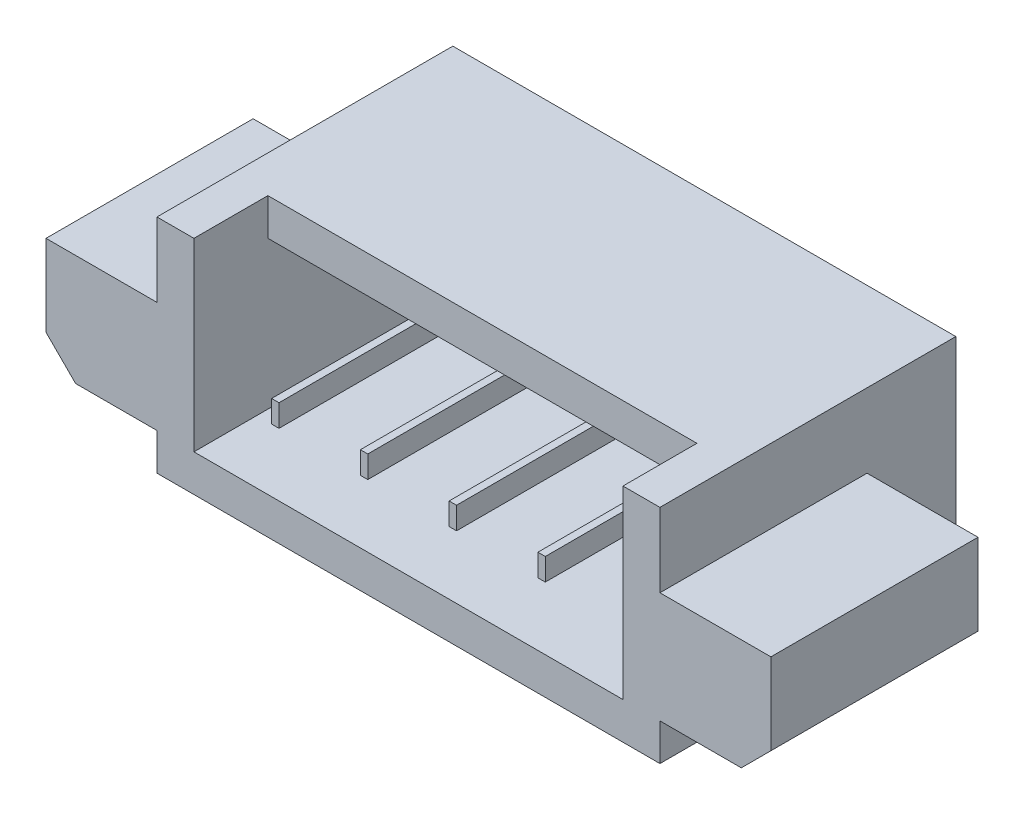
ISO-10303-21;
HEADER;
FILE_DESCRIPTION(('STEP AP214'),'2;1');
FILE_NAME('part.step','',(''),(''),'','','');
FILE_SCHEMA(('AUTOMOTIVE_DESIGN { 1 0 10303 214 1 1 1 1 }'));
ENDSEC;
DATA;
#1=APPLICATION_CONTEXT('core data for automotive mechanical design processes');
#2=APPLICATION_PROTOCOL_DEFINITION('international standard','automotive_design',2000,#1);
#3=PRODUCT_CONTEXT('',#1,'mechanical');
#4=PRODUCT('Part','Part','',(#3));
#5=PRODUCT_RELATED_PRODUCT_CATEGORY('part','',(#4));
#6=PRODUCT_DEFINITION_FORMATION('','',#4);
#7=PRODUCT_DEFINITION_CONTEXT('part definition',#1,'design');
#8=PRODUCT_DEFINITION('design','',#6,#7);
#9=PRODUCT_DEFINITION_SHAPE('','',#8);
#10=(LENGTH_UNIT() NAMED_UNIT(*) SI_UNIT(.MILLI.,.METRE.));
#11=(NAMED_UNIT(*) PLANE_ANGLE_UNIT() SI_UNIT($,.RADIAN.));
#12=(NAMED_UNIT(*) SI_UNIT($,.STERADIAN.) SOLID_ANGLE_UNIT());
#13=UNCERTAINTY_MEASURE_WITH_UNIT(LENGTH_MEASURE(1.E-05),#10,'distance_accuracy_value','');
#14=(GEOMETRIC_REPRESENTATION_CONTEXT(3) GLOBAL_UNCERTAINTY_ASSIGNED_CONTEXT((#13)) GLOBAL_UNIT_ASSIGNED_CONTEXT((#10,
#11,#12)) REPRESENTATION_CONTEXT('',''));
#15=CARTESIAN_POINT('',(0.,0.,0.));
#16=DIRECTION('',(0.,0.,1.));
#17=DIRECTION('',(1.,0.,0.));
#18=AXIS2_PLACEMENT_3D('',#15,#16,#17);
#19=CARTESIAN_POINT('',(0.,0.,0.5));
#20=DIRECTION('',(0.,0.,-1.));
#21=DIRECTION('',(-1.,0.,0.));
#22=AXIS2_PLACEMENT_3D('',#19,#20,#21);
#23=PLANE('',#22);
#24=DIRECTION('',(1.,0.,0.));
#25=VECTOR('',#24,1.);
#26=CARTESIAN_POINT('',(0.55,-0.15,0.5));
#27=LINE('',#26,#25);
#28=CARTESIAN_POINT('',(0.55,-0.15,0.5));
#29=VERTEX_POINT('',#28);
#30=CARTESIAN_POINT('',(0.65,-0.15,0.5));
#31=VERTEX_POINT('',#30);
#32=EDGE_CURVE('E288',#29,#31,#27,.T.);
#33=ORIENTED_EDGE('',*,*,#32,.F.);
#34=DIRECTION('',(0.,-1.,0.));
#35=VECTOR('',#34,1.);
#36=CARTESIAN_POINT('',(0.55,0.15,0.5));
#37=LINE('',#36,#35);
#38=CARTESIAN_POINT('',(0.55,0.15,0.5));
#39=VERTEX_POINT('',#38);
#40=EDGE_CURVE('E301',#39,#29,#37,.T.);
#41=ORIENTED_EDGE('',*,*,#40,.F.);
#42=DIRECTION('',(-1.,0.,0.));
#43=VECTOR('',#42,1.);
#44=CARTESIAN_POINT('',(0.55,0.15,0.5));
#45=LINE('',#44,#43);
#46=CARTESIAN_POINT('',(0.649999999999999,0.15,0.5));
#47=VERTEX_POINT('',#46);
#48=EDGE_CURVE('E310',#47,#39,#45,.T.);
#49=ORIENTED_EDGE('',*,*,#48,.F.);
#50=DIRECTION('',(0.,1.,0.));
#51=VECTOR('',#50,1.);
#52=CARTESIAN_POINT('',(0.649999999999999,0.15,0.5));
#53=LINE('',#52,#51);
#54=EDGE_CURVE('E291',#31,#47,#53,.T.);
#55=ORIENTED_EDGE('',*,*,#54,.F.);
#56=EDGE_LOOP('',(#33,#41,#49,#55));
#57=FACE_BOUND('',#56,.T.);
#58=DIRECTION('',(0.,1.,0.));
#59=VECTOR('',#58,1.);
#60=CARTESIAN_POINT('',(-1.75,0.15,0.5));
#61=LINE('',#60,#59);
#62=CARTESIAN_POINT('',(-1.75,-0.15,0.5));
#63=VERTEX_POINT('',#62);
#64=CARTESIAN_POINT('',(-1.75,0.15,0.5));
#65=VERTEX_POINT('',#64);
#66=EDGE_CURVE('E359',#63,#65,#61,.T.);
#67=ORIENTED_EDGE('',*,*,#66,.F.);
#68=DIRECTION('',(1.,0.,0.));
#69=VECTOR('',#68,1.);
#70=CARTESIAN_POINT('',(-1.85,-0.15,0.5));
#71=LINE('',#70,#69);
#72=CARTESIAN_POINT('',(-1.85,-0.15,0.5));
#73=VERTEX_POINT('',#72);
#74=EDGE_CURVE('E364',#73,#63,#71,.T.);
#75=ORIENTED_EDGE('',*,*,#74,.F.);
#76=DIRECTION('',(0.,-1.,0.));
#77=VECTOR('',#76,1.);
#78=CARTESIAN_POINT('',(-1.85,0.15,0.5));
#79=LINE('',#78,#77);
#80=CARTESIAN_POINT('',(-1.85,0.15,0.5));
#81=VERTEX_POINT('',#80);
#82=EDGE_CURVE('E376',#81,#73,#79,.T.);
#83=ORIENTED_EDGE('',*,*,#82,.F.);
#84=DIRECTION('',(-1.,0.,0.));
#85=VECTOR('',#84,1.);
#86=CARTESIAN_POINT('',(-1.85,0.15,0.5));
#87=LINE('',#86,#85);
#88=EDGE_CURVE('E373',#65,#81,#87,.T.);
#89=ORIENTED_EDGE('',*,*,#88,.F.);
#90=EDGE_LOOP('',(#67,#75,#83,#89));
#91=FACE_BOUND('',#90,.T.);
#92=DIRECTION('',(0.,1.,0.));
#93=VECTOR('',#92,1.);
#94=CARTESIAN_POINT('',(-2.9,1.,0.5));
#95=LINE('',#94,#93);
#96=CARTESIAN_POINT('',(-2.9,-1.,0.5));
#97=VERTEX_POINT('',#96);
#98=CARTESIAN_POINT('',(-2.9,1.,0.5));
#99=VERTEX_POINT('',#98);
#100=EDGE_CURVE('E414',#97,#99,#95,.T.);
#101=ORIENTED_EDGE('',*,*,#100,.F.);
#102=DIRECTION('',(-1.,0.,0.));
#103=VECTOR('',#102,1.);
#104=CARTESIAN_POINT('',(-2.9,-1.,0.5));
#105=LINE('',#104,#103);
#106=CARTESIAN_POINT('',(2.9,-1.,0.5));
#107=VERTEX_POINT('',#106);
#108=EDGE_CURVE('E411',#107,#97,#105,.T.);
#109=ORIENTED_EDGE('',*,*,#108,.F.);
#110=DIRECTION('',(0.,-1.,0.));
#111=VECTOR('',#110,1.);
#112=CARTESIAN_POINT('',(2.9,1.,0.5));
#113=LINE('',#112,#111);
#114=CARTESIAN_POINT('',(2.9,1.,0.5));
#115=VERTEX_POINT('',#114);
#116=EDGE_CURVE('E407',#115,#107,#113,.T.);
#117=ORIENTED_EDGE('',*,*,#116,.F.);
#118=DIRECTION('',(1.,0.,0.));
#119=VECTOR('',#118,1.);
#120=CARTESIAN_POINT('',(-2.9,1.,0.5));
#121=LINE('',#120,#119);
#122=EDGE_CURVE('E11',#99,#115,#121,.T.);
#123=ORIENTED_EDGE('',*,*,#122,.F.);
#124=EDGE_LOOP('',(#101,#109,#117,#123));
#125=FACE_BOUND('',#124,.T.);
#126=DIRECTION('',(1.,0.,0.));
#127=VECTOR('',#126,1.);
#128=CARTESIAN_POINT('',(-0.65,-0.15,0.5));
#129=LINE('',#128,#127);
#130=CARTESIAN_POINT('',(-0.65,-0.15,0.5));
#131=VERTEX_POINT('',#130);
#132=CARTESIAN_POINT('',(-0.55,-0.15,0.5));
#133=VERTEX_POINT('',#132);
#134=EDGE_CURVE('E326',#131,#133,#129,.T.);
#135=ORIENTED_EDGE('',*,*,#134,.F.);
#136=DIRECTION('',(0.,-1.,0.));
#137=VECTOR('',#136,1.);
#138=CARTESIAN_POINT('',(-0.65,0.15,0.5));
#139=LINE('',#138,#137);
#140=CARTESIAN_POINT('',(-0.65,0.15,0.5));
#141=VERTEX_POINT('',#140);
#142=EDGE_CURVE('E331',#141,#131,#139,.T.);
#143=ORIENTED_EDGE('',*,*,#142,.F.);
#144=DIRECTION('',(-1.,0.,0.));
#145=VECTOR('',#144,1.);
#146=CARTESIAN_POINT('',(-0.65,0.15,0.5));
#147=LINE('',#146,#145);
#148=CARTESIAN_POINT('',(-0.55,0.15,0.5));
#149=VERTEX_POINT('',#148);
#150=EDGE_CURVE('E343',#149,#141,#147,.T.);
#151=ORIENTED_EDGE('',*,*,#150,.F.);
#152=DIRECTION('',(0.,1.,0.));
#153=VECTOR('',#152,1.);
#154=CARTESIAN_POINT('',(-0.55,0.15,0.5));
#155=LINE('',#154,#153);
#156=EDGE_CURVE('E340',#133,#149,#155,.T.);
#157=ORIENTED_EDGE('',*,*,#156,.F.);
#158=EDGE_LOOP('',(#135,#143,#151,#157));
#159=FACE_BOUND('',#158,.T.);
#160=DIRECTION('',(1.,0.,0.));
#161=VECTOR('',#160,1.);
#162=CARTESIAN_POINT('',(1.75,-0.15,0.5));
#163=LINE('',#162,#161);
#164=CARTESIAN_POINT('',(1.75,-0.15,0.5));
#165=VERTEX_POINT('',#164);
#166=CARTESIAN_POINT('',(1.85,-0.15,0.5));
#167=VERTEX_POINT('',#166);
#168=EDGE_CURVE('E287',#165,#167,#163,.T.);
#169=ORIENTED_EDGE('',*,*,#168,.F.);
#170=DIRECTION('',(0.,-1.,0.));
#171=VECTOR('',#170,1.);
#172=CARTESIAN_POINT('',(1.75,0.15,0.5));
#173=LINE('',#172,#171);
#174=CARTESIAN_POINT('',(1.75,0.15,0.5));
#175=VERTEX_POINT('',#174);
#176=EDGE_CURVE('E284',#175,#165,#173,.T.);
#177=ORIENTED_EDGE('',*,*,#176,.F.);
#178=DIRECTION('',(-1.,0.,0.));
#179=VECTOR('',#178,1.);
#180=CARTESIAN_POINT('',(1.75,0.15,0.5));
#181=LINE('',#180,#179);
#182=CARTESIAN_POINT('',(1.85,0.15,0.5));
#183=VERTEX_POINT('',#182);
#184=EDGE_CURVE('E54',#183,#175,#181,.T.);
#185=ORIENTED_EDGE('',*,*,#184,.F.);
#186=DIRECTION('',(0.,1.,0.));
#187=VECTOR('',#186,1.);
#188=CARTESIAN_POINT('',(1.85,0.15,0.5));
#189=LINE('',#188,#187);
#190=EDGE_CURVE('E49',#167,#183,#189,.T.);
#191=ORIENTED_EDGE('',*,*,#190,.F.);
#192=EDGE_LOOP('',(#169,#177,#185,#191));
#193=FACE_BOUND('',#192,.T.);
#194=ADVANCED_FACE('F34',(#57,#91,#125,#159,#193),#23,.F.);
#195=CARTESIAN_POINT('',(-2.9,1.,4.));
#196=DIRECTION('',(1.,0.,0.));
#197=DIRECTION('',(0.,0.,-1.));
#198=AXIS2_PLACEMENT_3D('',#195,#196,#197);
#199=PLANE('',#198);
#200=DIRECTION('',(0.,0.,-1.));
#201=VECTOR('',#200,1.);
#202=CARTESIAN_POINT('',(-2.9,-1.,4.));
#203=LINE('',#202,#201);
#204=CARTESIAN_POINT('',(-2.9,-1.,4.));
#205=VERTEX_POINT('',#204);
#206=EDGE_CURVE('E505',#205,#97,#203,.T.);
#207=ORIENTED_EDGE('',*,*,#206,.T.);
#208=ORIENTED_EDGE('',*,*,#100,.T.);
#209=DIRECTION('',(0.,0.,-1.));
#210=VECTOR('',#209,1.);
#211=CARTESIAN_POINT('',(-2.9,1.,4.));
#212=LINE('',#211,#210);
#213=CARTESIAN_POINT('',(-2.9,1.,3.));
#214=VERTEX_POINT('',#213);
#215=EDGE_CURVE('E498',#214,#99,#212,.T.);
#216=ORIENTED_EDGE('',*,*,#215,.F.);
#217=DIRECTION('',(0.,1.,0.));
#218=VECTOR('',#217,1.);
#219=CARTESIAN_POINT('',(-2.9,1.,3.));
#220=LINE('',#219,#218);
#221=CARTESIAN_POINT('',(-2.9,1.5,3.));
#222=VERTEX_POINT('',#221);
#223=EDGE_CURVE('E405',#214,#222,#220,.T.);
#224=ORIENTED_EDGE('',*,*,#223,.T.);
#225=DIRECTION('',(0.,0.,1.));
#226=VECTOR('',#225,1.);
#227=CARTESIAN_POINT('',(-2.9,1.5,4.));
#228=LINE('',#227,#226);
#229=CARTESIAN_POINT('',(-2.9,1.5,4.));
#230=VERTEX_POINT('',#229);
#231=EDGE_CURVE('E392',#222,#230,#228,.T.);
#232=ORIENTED_EDGE('',*,*,#231,.T.);
#233=DIRECTION('',(0.,-1.,0.));
#234=VECTOR('',#233,1.);
#235=CARTESIAN_POINT('',(-2.9,1.,4.));
#236=LINE('',#235,#234);
#237=EDGE_CURVE('E484',#230,#205,#236,.T.);
#238=ORIENTED_EDGE('',*,*,#237,.T.);
#239=EDGE_LOOP('',(#207,#208,#216,#224,#232,#238));
#240=FACE_BOUND('',#239,.T.);
#241=ADVANCED_FACE('F572',(#240),#199,.T.);
#242=CARTESIAN_POINT('',(-2.9,-1.,4.));
#243=DIRECTION('',(0.,1.,0.));
#244=DIRECTION('',(-1.,0.,0.));
#245=AXIS2_PLACEMENT_3D('',#242,#243,#244);
#246=PLANE('',#245);
#247=DIRECTION('',(0.,0.,-1.));
#248=VECTOR('',#247,1.);
#249=CARTESIAN_POINT('',(2.9,-1.,4.));
#250=LINE('',#249,#248);
#251=CARTESIAN_POINT('',(2.9,-1.,4.));
#252=VERTEX_POINT('',#251);
#253=EDGE_CURVE('E502',#252,#107,#250,.T.);
#254=ORIENTED_EDGE('',*,*,#253,.T.);
#255=ORIENTED_EDGE('',*,*,#108,.T.);
#256=ORIENTED_EDGE('',*,*,#206,.F.);
#257=DIRECTION('',(1.,0.,0.));
#258=VECTOR('',#257,1.);
#259=CARTESIAN_POINT('',(-2.9,-1.,4.));
#260=LINE('',#259,#258);
#261=EDGE_CURVE('E494',#205,#252,#260,.T.);
#262=ORIENTED_EDGE('',*,*,#261,.T.);
#263=EDGE_LOOP('',(#254,#255,#256,#262));
#264=FACE_BOUND('',#263,.T.);
#265=ADVANCED_FACE('F624',(#264),#246,.T.);
#266=CARTESIAN_POINT('',(2.9,1.,4.));
#267=DIRECTION('',(-1.,0.,0.));
#268=DIRECTION('',(0.,-1.,0.));
#269=AXIS2_PLACEMENT_3D('',#266,#267,#268);
#270=PLANE('',#269);
#271=DIRECTION('',(0.,1.,0.));
#272=VECTOR('',#271,1.);
#273=CARTESIAN_POINT('',(2.9,1.,4.));
#274=LINE('',#273,#272);
#275=CARTESIAN_POINT('',(2.9,1.5,4.));
#276=VERTEX_POINT('',#275);
#277=EDGE_CURVE('E496',#252,#276,#274,.T.);
#278=ORIENTED_EDGE('',*,*,#277,.T.);
#279=DIRECTION('',(0.,0.,-1.));
#280=VECTOR('',#279,1.);
#281=CARTESIAN_POINT('',(2.9,1.5,4.));
#282=LINE('',#281,#280);
#283=CARTESIAN_POINT('',(2.9,1.5,3.));
#284=VERTEX_POINT('',#283);
#285=EDGE_CURVE('E400',#276,#284,#282,.T.);
#286=ORIENTED_EDGE('',*,*,#285,.T.);
#287=DIRECTION('',(0.,1.,0.));
#288=VECTOR('',#287,1.);
#289=CARTESIAN_POINT('',(2.9,1.,3.));
#290=LINE('',#289,#288);
#291=CARTESIAN_POINT('',(2.9,1.,3.));
#292=VERTEX_POINT('',#291);
#293=EDGE_CURVE('E396',#292,#284,#290,.T.);
#294=ORIENTED_EDGE('',*,*,#293,.F.);
#295=DIRECTION('',(0.,0.,-1.));
#296=VECTOR('',#295,1.);
#297=CARTESIAN_POINT('',(2.9,1.,4.));
#298=LINE('',#297,#296);
#299=EDGE_CURVE('E500',#292,#115,#298,.T.);
#300=ORIENTED_EDGE('',*,*,#299,.T.);
#301=ORIENTED_EDGE('',*,*,#116,.T.);
#302=ORIENTED_EDGE('',*,*,#253,.F.);
#303=EDGE_LOOP('',(#278,#286,#294,#300,#301,#302));
#304=FACE_BOUND('',#303,.T.);
#305=ADVANCED_FACE('F655',(#304),#270,.T.);
#306=CARTESIAN_POINT('',(-2.9,1.,4.));
#307=DIRECTION('',(0.,-1.,0.));
#308=DIRECTION('',(0.,0.,-1.));
#309=AXIS2_PLACEMENT_3D('',#306,#307,#308);
#310=PLANE('',#309);
#311=DIRECTION('',(-1.,0.,0.));
#312=VECTOR('',#311,1.);
#313=CARTESIAN_POINT('',(-2.9,1.,3.));
#314=LINE('',#313,#312);
#315=EDGE_CURVE('E393',#292,#214,#314,.T.);
#316=ORIENTED_EDGE('',*,*,#315,.T.);
#317=ORIENTED_EDGE('',*,*,#215,.T.);
#318=ORIENTED_EDGE('',*,*,#122,.T.);
#319=ORIENTED_EDGE('',*,*,#299,.F.);
#320=EDGE_LOOP('',(#316,#317,#318,#319));
#321=FACE_BOUND('',#320,.T.);
#322=ADVANCED_FACE('F652',(#321),#310,.T.);
#323=CARTESIAN_POINT('',(3.4,1.5,4.));
#324=DIRECTION('',(-1.,0.,0.));
#325=DIRECTION('',(0.,-1.,0.));
#326=AXIS2_PLACEMENT_3D('',#323,#324,#325);
#327=PLANE('',#326);
#328=DIRECTION('',(0.,1.,0.));
#329=VECTOR('',#328,1.);
#330=CARTESIAN_POINT('',(3.4,1.5,0.));
#331=LINE('',#330,#329);
#332=CARTESIAN_POINT('',(3.4,-1.5,0.));
#333=VERTEX_POINT('',#332);
#334=CARTESIAN_POINT('',(3.4,1.5,0.));
#335=VERTEX_POINT('',#334);
#336=EDGE_CURVE('E508',#333,#335,#331,.T.);
#337=ORIENTED_EDGE('',*,*,#336,.T.);
#338=DIRECTION('',(0.,0.,-1.));
#339=VECTOR('',#338,1.);
#340=CARTESIAN_POINT('',(3.4,1.5,4.));
#341=LINE('',#340,#339);
#342=CARTESIAN_POINT('',(3.4,1.5,4.));
#343=VERTEX_POINT('',#342);
#344=EDGE_CURVE('E42',#343,#335,#341,.T.);
#345=ORIENTED_EDGE('',*,*,#344,.F.);
#346=DIRECTION('',(0.,1.,0.));
#347=VECTOR('',#346,1.);
#348=CARTESIAN_POINT('',(3.4,1.5,4.));
#349=LINE('',#348,#347);
#350=CARTESIAN_POINT('',(3.4,0.5,4.));
#351=VERTEX_POINT('',#350);
#352=EDGE_CURVE('E513',#351,#343,#349,.T.);
#353=ORIENTED_EDGE('',*,*,#352,.F.);
#354=DIRECTION('',(0.,0.,1.));
#355=VECTOR('',#354,1.);
#356=CARTESIAN_POINT('',(3.4,0.5,1.2));
#357=LINE('',#356,#355);
#358=CARTESIAN_POINT('',(3.4,0.5,1.2));
#359=VERTEX_POINT('',#358);
#360=EDGE_CURVE('E448',#359,#351,#357,.T.);
#361=ORIENTED_EDGE('',*,*,#360,.F.);
#362=DIRECTION('',(0.,-1.,0.));
#363=VECTOR('',#362,1.);
#364=CARTESIAN_POINT('',(3.4,-1.,1.2));
#365=LINE('',#364,#363);
#366=CARTESIAN_POINT('',(3.4,-1.,1.2));
#367=VERTEX_POINT('',#366);
#368=EDGE_CURVE('E430',#359,#367,#365,.T.);
#369=ORIENTED_EDGE('',*,*,#368,.T.);
#370=DIRECTION('',(0.,0.,1.));
#371=VECTOR('',#370,1.);
#372=CARTESIAN_POINT('',(3.4,-1.,1.2));
#373=LINE('',#372,#371);
#374=CARTESIAN_POINT('',(3.4,-1.,4.));
#375=VERTEX_POINT('',#374);
#376=EDGE_CURVE('E444',#367,#375,#373,.T.);
#377=ORIENTED_EDGE('',*,*,#376,.T.);
#378=CARTESIAN_POINT('',(3.4,-1.5,4.));
#379=VERTEX_POINT('',#378);
#380=EDGE_CURVE('E509',#379,#375,#349,.T.);
#381=ORIENTED_EDGE('',*,*,#380,.F.);
#382=DIRECTION('',(0.,0.,-1.));
#383=VECTOR('',#382,1.);
#384=CARTESIAN_POINT('',(3.4,-1.5,4.));
#385=LINE('',#384,#383);
#386=EDGE_CURVE('E523',#379,#333,#385,.T.);
#387=ORIENTED_EDGE('',*,*,#386,.T.);
#388=EDGE_LOOP('',(#337,#345,#353,#361,#369,#377,#381,#387));
#389=FACE_BOUND('',#388,.T.);
#390=ADVANCED_FACE('F36',(#389),#327,.F.);
#391=CARTESIAN_POINT('',(-3.4,1.5,4.));
#392=DIRECTION('',(1.,0.,0.));
#393=DIRECTION('',(0.,0.,-1.));
#394=AXIS2_PLACEMENT_3D('',#391,#392,#393);
#395=PLANE('',#394);
#396=DIRECTION('',(0.,-1.,0.));
#397=VECTOR('',#396,1.);
#398=CARTESIAN_POINT('',(-3.4,1.5,0.));
#399=LINE('',#398,#397);
#400=CARTESIAN_POINT('',(-3.4,1.5,0.));
#401=VERTEX_POINT('',#400);
#402=CARTESIAN_POINT('',(-3.4,-1.5,0.));
#403=VERTEX_POINT('',#402);
#404=EDGE_CURVE('E529',#401,#403,#399,.T.);
#405=ORIENTED_EDGE('',*,*,#404,.T.);
#406=DIRECTION('',(0.,0.,-1.));
#407=VECTOR('',#406,1.);
#408=CARTESIAN_POINT('',(-3.4,-1.5,4.));
#409=LINE('',#408,#407);
#410=CARTESIAN_POINT('',(-3.4,-1.5,4.));
#411=VERTEX_POINT('',#410);
#412=EDGE_CURVE('E536',#411,#403,#409,.T.);
#413=ORIENTED_EDGE('',*,*,#412,.F.);
#414=DIRECTION('',(0.,-1.,0.));
#415=VECTOR('',#414,1.);
#416=CARTESIAN_POINT('',(-3.4,1.5,4.));
#417=LINE('',#416,#415);
#418=CARTESIAN_POINT('',(-3.4,-1.,4.));
#419=VERTEX_POINT('',#418);
#420=EDGE_CURVE('E517',#419,#411,#417,.T.);
#421=ORIENTED_EDGE('',*,*,#420,.F.);
#422=DIRECTION('',(0.,0.,1.));
#423=VECTOR('',#422,1.);
#424=CARTESIAN_POINT('',(-3.4,-1.,1.2));
#425=LINE('',#424,#423);
#426=CARTESIAN_POINT('',(-3.4,-1.,1.2));
#427=VERTEX_POINT('',#426);
#428=EDGE_CURVE('E482',#427,#419,#425,.T.);
#429=ORIENTED_EDGE('',*,*,#428,.F.);
#430=DIRECTION('',(0.,1.,0.));
#431=VECTOR('',#430,1.);
#432=CARTESIAN_POINT('',(-3.4,-1.,1.2));
#433=LINE('',#432,#431);
#434=CARTESIAN_POINT('',(-3.4,0.499999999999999,1.2));
#435=VERTEX_POINT('',#434);
#436=EDGE_CURVE('E455',#427,#435,#433,.T.);
#437=ORIENTED_EDGE('',*,*,#436,.T.);
#438=DIRECTION('',(0.,0.,1.));
#439=VECTOR('',#438,1.);
#440=CARTESIAN_POINT('',(-3.4,0.499999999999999,1.2));
#441=LINE('',#440,#439);
#442=CARTESIAN_POINT('',(-3.4,0.499999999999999,4.));
#443=VERTEX_POINT('',#442);
#444=EDGE_CURVE('E471',#435,#443,#441,.T.);
#445=ORIENTED_EDGE('',*,*,#444,.T.);
#446=CARTESIAN_POINT('',(-3.4,1.5,4.));
#447=VERTEX_POINT('',#446);
#448=EDGE_CURVE('E518',#447,#443,#417,.T.);
#449=ORIENTED_EDGE('',*,*,#448,.F.);
#450=DIRECTION('',(0.,0.,-1.));
#451=VECTOR('',#450,1.);
#452=CARTESIAN_POINT('',(-3.4,1.5,4.));
#453=LINE('',#452,#451);
#454=EDGE_CURVE('E538',#447,#401,#453,.T.);
#455=ORIENTED_EDGE('',*,*,#454,.T.);
#456=EDGE_LOOP('',(#405,#413,#421,#429,#437,#445,#449,#455));
#457=FACE_BOUND('',#456,.T.);
#458=ADVANCED_FACE('F562',(#457),#395,.F.);
#459=CARTESIAN_POINT('',(0.,0.,4.));
#460=DIRECTION('',(0.,0.,1.));
#461=DIRECTION('',(1.,0.,0.));
#462=AXIS2_PLACEMENT_3D('',#459,#460,#461);
#463=PLANE('',#462);
#464=ORIENTED_EDGE('',*,*,#237,.F.);
#465=DIRECTION('',(-1.,0.,0.));
#466=VECTOR('',#465,1.);
#467=CARTESIAN_POINT('',(-3.4,1.5,4.));
#468=LINE('',#467,#466);
#469=EDGE_CURVE('E512',#230,#447,#468,.T.);
#470=ORIENTED_EDGE('',*,*,#469,.T.);
#471=ORIENTED_EDGE('',*,*,#448,.T.);
#472=DIRECTION('',(-1.,0.,0.));
#473=VECTOR('',#472,1.);
#474=CARTESIAN_POINT('',(-3.4,0.499999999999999,4.));
#475=LINE('',#474,#473);
#476=CARTESIAN_POINT('',(-4.9,0.499999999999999,4.));
#477=VERTEX_POINT('',#476);
#478=EDGE_CURVE('E447',#443,#477,#475,.T.);
#479=ORIENTED_EDGE('',*,*,#478,.T.);
#480=DIRECTION('',(0.,-1.,0.));
#481=VECTOR('',#480,1.);
#482=CARTESIAN_POINT('',(-4.9,-0.600000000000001,4.));
#483=LINE('',#482,#481);
#484=CARTESIAN_POINT('',(-4.9,-0.600000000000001,4.));
#485=VERTEX_POINT('',#484);
#486=EDGE_CURVE('E474',#477,#485,#483,.T.);
#487=ORIENTED_EDGE('',*,*,#486,.T.);
#488=DIRECTION('',(0.707106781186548,-0.707106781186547,0.));
#489=VECTOR('',#488,1.);
#490=CARTESIAN_POINT('',(-4.5,-1.,4.));
#491=LINE('',#490,#489);
#492=CARTESIAN_POINT('',(-4.5,-1.,4.));
#493=VERTEX_POINT('',#492);
#494=EDGE_CURVE('E477',#485,#493,#491,.T.);
#495=ORIENTED_EDGE('',*,*,#494,.T.);
#496=DIRECTION('',(1.,0.,0.));
#497=VECTOR('',#496,1.);
#498=CARTESIAN_POINT('',(-3.4,-1.,4.));
#499=LINE('',#498,#497);
#500=EDGE_CURVE('E459',#493,#419,#499,.T.);
#501=ORIENTED_EDGE('',*,*,#500,.T.);
#502=ORIENTED_EDGE('',*,*,#420,.T.);
#503=DIRECTION('',(1.,0.,0.));
#504=VECTOR('',#503,1.);
#505=CARTESIAN_POINT('',(-3.4,-1.5,4.));
#506=LINE('',#505,#504);
#507=EDGE_CURVE('E521',#411,#379,#506,.T.);
#508=ORIENTED_EDGE('',*,*,#507,.T.);
#509=ORIENTED_EDGE('',*,*,#380,.T.);
#510=DIRECTION('',(1.,0.,0.));
#511=VECTOR('',#510,1.);
#512=CARTESIAN_POINT('',(3.4,-1.,4.));
#513=LINE('',#512,#511);
#514=CARTESIAN_POINT('',(4.5,-0.999999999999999,4.));
#515=VERTEX_POINT('',#514);
#516=EDGE_CURVE('E417',#375,#515,#513,.T.);
#517=ORIENTED_EDGE('',*,*,#516,.T.);
#518=DIRECTION('',(0.707106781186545,0.707106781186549,0.));
#519=VECTOR('',#518,1.);
#520=CARTESIAN_POINT('',(4.5,-0.999999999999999,4.));
#521=LINE('',#520,#519);
#522=CARTESIAN_POINT('',(4.9,-0.6,4.));
#523=VERTEX_POINT('',#522);
#524=EDGE_CURVE('E436',#515,#523,#521,.T.);
#525=ORIENTED_EDGE('',*,*,#524,.T.);
#526=DIRECTION('',(0.,1.,0.));
#527=VECTOR('',#526,1.);
#528=CARTESIAN_POINT('',(4.9,-0.6,4.));
#529=LINE('',#528,#527);
#530=CARTESIAN_POINT('',(4.9,0.5,4.));
#531=VERTEX_POINT('',#530);
#532=EDGE_CURVE('E439',#523,#531,#529,.T.);
#533=ORIENTED_EDGE('',*,*,#532,.T.);
#534=DIRECTION('',(-1.,0.,0.));
#535=VECTOR('',#534,1.);
#536=CARTESIAN_POINT('',(3.4,0.5,4.));
#537=LINE('',#536,#535);
#538=EDGE_CURVE('E422',#531,#351,#537,.T.);
#539=ORIENTED_EDGE('',*,*,#538,.T.);
#540=ORIENTED_EDGE('',*,*,#352,.T.);
#541=EDGE_CURVE('E514',#343,#276,#468,.T.);
#542=ORIENTED_EDGE('',*,*,#541,.T.);
#543=ORIENTED_EDGE('',*,*,#277,.F.);
#544=ORIENTED_EDGE('',*,*,#261,.F.);
#545=EDGE_LOOP('',(#464,#470,#471,#479,#487,#495,#501,#502,#508,#509,#517,#525,#533,#539,#540,
#542,#543,#544));
#546=FACE_BOUND('',#545,.T.);
#547=ADVANCED_FACE('F567',(#546),#463,.T.);
#548=CARTESIAN_POINT('',(0.,0.,0.));
#549=DIRECTION('',(0.,0.,1.));
#550=DIRECTION('',(1.,0.,0.));
#551=AXIS2_PLACEMENT_3D('',#548,#549,#550);
#552=PLANE('',#551);
#553=ORIENTED_EDGE('',*,*,#336,.F.);
#554=DIRECTION('',(1.,0.,0.));
#555=VECTOR('',#554,1.);
#556=CARTESIAN_POINT('',(-3.4,-1.5,0.));
#557=LINE('',#556,#555);
#558=EDGE_CURVE('E532',#403,#333,#557,.T.);
#559=ORIENTED_EDGE('',*,*,#558,.F.);
#560=ORIENTED_EDGE('',*,*,#404,.F.);
#561=DIRECTION('',(-1.,0.,0.));
#562=VECTOR('',#561,1.);
#563=CARTESIAN_POINT('',(-3.4,1.5,0.));
#564=LINE('',#563,#562);
#565=EDGE_CURVE('E526',#335,#401,#564,.T.);
#566=ORIENTED_EDGE('',*,*,#565,.F.);
#567=EDGE_LOOP('',(#553,#559,#560,#566));
#568=FACE_BOUND('',#567,.T.);
#569=ADVANCED_FACE('F552',(#568),#552,.F.);
#570=CARTESIAN_POINT('',(-3.4,1.5,4.));
#571=DIRECTION('',(0.,-1.,0.));
#572=DIRECTION('',(0.,0.,-1.));
#573=AXIS2_PLACEMENT_3D('',#570,#571,#572);
#574=PLANE('',#573);
#575=ORIENTED_EDGE('',*,*,#469,.F.);
#576=ORIENTED_EDGE('',*,*,#231,.F.);
#577=DIRECTION('',(-1.,0.,0.));
#578=VECTOR('',#577,1.);
#579=CARTESIAN_POINT('',(-2.9,1.5,3.));
#580=LINE('',#579,#578);
#581=EDGE_CURVE('E397',#284,#222,#580,.T.);
#582=ORIENTED_EDGE('',*,*,#581,.F.);
#583=ORIENTED_EDGE('',*,*,#285,.F.);
#584=ORIENTED_EDGE('',*,*,#541,.F.);
#585=ORIENTED_EDGE('',*,*,#344,.T.);
#586=ORIENTED_EDGE('',*,*,#565,.T.);
#587=ORIENTED_EDGE('',*,*,#454,.F.);
#588=EDGE_LOOP('',(#575,#576,#582,#583,#584,#585,#586,#587));
#589=FACE_BOUND('',#588,.T.);
#590=ADVANCED_FACE('F544',(#589),#574,.F.);
#591=CARTESIAN_POINT('',(-3.4,-1.5,4.));
#592=DIRECTION('',(0.,1.,0.));
#593=DIRECTION('',(0.,0.,1.));
#594=AXIS2_PLACEMENT_3D('',#591,#592,#593);
#595=PLANE('',#594);
#596=ORIENTED_EDGE('',*,*,#558,.T.);
#597=ORIENTED_EDGE('',*,*,#386,.F.);
#598=ORIENTED_EDGE('',*,*,#507,.F.);
#599=ORIENTED_EDGE('',*,*,#412,.T.);
#600=EDGE_LOOP('',(#596,#597,#598,#599));
#601=FACE_BOUND('',#600,.T.);
#602=ADVANCED_FACE('F558',(#601),#595,.F.);
#603=CARTESIAN_POINT('',(-3.4,-1.,1.2));
#604=DIRECTION('',(0.,-1.,0.));
#605=DIRECTION('',(0.,0.,-1.));
#606=AXIS2_PLACEMENT_3D('',#603,#604,#605);
#607=PLANE('',#606);
#608=ORIENTED_EDGE('',*,*,#500,.F.);
#609=DIRECTION('',(0.,0.,1.));
#610=VECTOR('',#609,1.);
#611=CARTESIAN_POINT('',(-4.5,-1.,1.2));
#612=LINE('',#611,#610);
#613=CARTESIAN_POINT('',(-4.5,-1.,1.2));
#614=VERTEX_POINT('',#613);
#615=EDGE_CURVE('E485',#614,#493,#612,.T.);
#616=ORIENTED_EDGE('',*,*,#615,.F.);
#617=DIRECTION('',(1.,0.,0.));
#618=VECTOR('',#617,1.);
#619=CARTESIAN_POINT('',(-3.4,-1.,1.2));
#620=LINE('',#619,#618);
#621=EDGE_CURVE('E468',#614,#427,#620,.T.);
#622=ORIENTED_EDGE('',*,*,#621,.T.);
#623=ORIENTED_EDGE('',*,*,#428,.T.);
#624=EDGE_LOOP('',(#608,#616,#622,#623));
#625=FACE_BOUND('',#624,.T.);
#626=ADVANCED_FACE('F595',(#625),#607,.T.);
#627=CARTESIAN_POINT('',(-4.5,-1.,1.2));
#628=DIRECTION('',(-0.707106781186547,-0.707106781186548,0.));
#629=DIRECTION('',(0.707106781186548,-0.707106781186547,0.));
#630=AXIS2_PLACEMENT_3D('',#627,#628,#629);
#631=PLANE('',#630);
#632=ORIENTED_EDGE('',*,*,#494,.F.);
#633=DIRECTION('',(0.,0.,1.));
#634=VECTOR('',#633,1.);
#635=CARTESIAN_POINT('',(-4.9,-0.600000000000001,1.2));
#636=LINE('',#635,#634);
#637=CARTESIAN_POINT('',(-4.9,-0.600000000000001,1.2));
#638=VERTEX_POINT('',#637);
#639=EDGE_CURVE('E487',#638,#485,#636,.T.);
#640=ORIENTED_EDGE('',*,*,#639,.F.);
#641=DIRECTION('',(0.707106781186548,-0.707106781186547,0.));
#642=VECTOR('',#641,1.);
#643=CARTESIAN_POINT('',(-4.5,-1.,1.2));
#644=LINE('',#643,#642);
#645=EDGE_CURVE('E465',#638,#614,#644,.T.);
#646=ORIENTED_EDGE('',*,*,#645,.T.);
#647=ORIENTED_EDGE('',*,*,#615,.T.);
#648=EDGE_LOOP('',(#632,#640,#646,#647));
#649=FACE_BOUND('',#648,.T.);
#650=ADVANCED_FACE('F609',(#649),#631,.T.);
#651=CARTESIAN_POINT('',(-4.9,-0.600000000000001,1.2));
#652=DIRECTION('',(-1.,0.,0.));
#653=DIRECTION('',(0.,0.,1.));
#654=AXIS2_PLACEMENT_3D('',#651,#652,#653);
#655=PLANE('',#654);
#656=ORIENTED_EDGE('',*,*,#486,.F.);
#657=DIRECTION('',(0.,0.,1.));
#658=VECTOR('',#657,1.);
#659=CARTESIAN_POINT('',(-4.9,0.499999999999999,1.2));
#660=LINE('',#659,#658);
#661=CARTESIAN_POINT('',(-4.9,0.499999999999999,1.2));
#662=VERTEX_POINT('',#661);
#663=EDGE_CURVE('E489',#662,#477,#660,.T.);
#664=ORIENTED_EDGE('',*,*,#663,.F.);
#665=DIRECTION('',(0.,-1.,0.));
#666=VECTOR('',#665,1.);
#667=CARTESIAN_POINT('',(-4.9,-0.600000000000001,1.2));
#668=LINE('',#667,#666);
#669=EDGE_CURVE('E462',#662,#638,#668,.T.);
#670=ORIENTED_EDGE('',*,*,#669,.T.);
#671=ORIENTED_EDGE('',*,*,#639,.T.);
#672=EDGE_LOOP('',(#656,#664,#670,#671));
#673=FACE_BOUND('',#672,.T.);
#674=ADVANCED_FACE('F607',(#673),#655,.T.);
#675=CARTESIAN_POINT('',(-3.4,0.499999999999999,1.2));
#676=DIRECTION('',(0.,1.,0.));
#677=DIRECTION('',(-1.,0.,0.));
#678=AXIS2_PLACEMENT_3D('',#675,#676,#677);
#679=PLANE('',#678);
#680=ORIENTED_EDGE('',*,*,#478,.F.);
#681=ORIENTED_EDGE('',*,*,#444,.F.);
#682=DIRECTION('',(-1.,0.,0.));
#683=VECTOR('',#682,1.);
#684=CARTESIAN_POINT('',(-3.4,0.499999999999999,1.2));
#685=LINE('',#684,#683);
#686=EDGE_CURVE('E458',#435,#662,#685,.T.);
#687=ORIENTED_EDGE('',*,*,#686,.T.);
#688=ORIENTED_EDGE('',*,*,#663,.T.);
#689=EDGE_LOOP('',(#680,#681,#687,#688));
#690=FACE_BOUND('',#689,.T.);
#691=ADVANCED_FACE('F603',(#690),#679,.T.);
#692=CARTESIAN_POINT('',(0.,0.,1.2));
#693=DIRECTION('',(0.,0.,1.));
#694=DIRECTION('',(1.,0.,0.));
#695=AXIS2_PLACEMENT_3D('',#692,#693,#694);
#696=PLANE('',#695);
#697=ORIENTED_EDGE('',*,*,#436,.F.);
#698=ORIENTED_EDGE('',*,*,#621,.F.);
#699=ORIENTED_EDGE('',*,*,#645,.F.);
#700=ORIENTED_EDGE('',*,*,#669,.F.);
#701=ORIENTED_EDGE('',*,*,#686,.F.);
#702=EDGE_LOOP('',(#697,#698,#699,#700,#701));
#703=FACE_BOUND('',#702,.T.);
#704=ADVANCED_FACE('F599',(#703),#696,.F.);
#705=CARTESIAN_POINT('',(3.4,-1.,1.2));
#706=DIRECTION('',(0.,-1.,0.));
#707=DIRECTION('',(1.,0.,0.));
#708=AXIS2_PLACEMENT_3D('',#705,#706,#707);
#709=PLANE('',#708);
#710=ORIENTED_EDGE('',*,*,#516,.F.);
#711=ORIENTED_EDGE('',*,*,#376,.F.);
#712=DIRECTION('',(1.,0.,0.));
#713=VECTOR('',#712,1.);
#714=CARTESIAN_POINT('',(3.4,-1.,1.2));
#715=LINE('',#714,#713);
#716=CARTESIAN_POINT('',(4.5,-0.999999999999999,1.2));
#717=VERTEX_POINT('',#716);
#718=EDGE_CURVE('E418',#367,#717,#715,.T.);
#719=ORIENTED_EDGE('',*,*,#718,.T.);
#720=DIRECTION('',(0.,0.,1.));
#721=VECTOR('',#720,1.);
#722=CARTESIAN_POINT('',(4.5,-0.999999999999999,1.2));
#723=LINE('',#722,#721);
#724=EDGE_CURVE('E433',#717,#515,#723,.T.);
#725=ORIENTED_EDGE('',*,*,#724,.T.);
#726=EDGE_LOOP('',(#710,#711,#719,#725));
#727=FACE_BOUND('',#726,.T.);
#728=ADVANCED_FACE('F590',(#727),#709,.T.);
#729=CARTESIAN_POINT('',(3.4,0.5,1.2));
#730=DIRECTION('',(0.,1.,0.));
#731=DIRECTION('',(-1.,0.,0.));
#732=AXIS2_PLACEMENT_3D('',#729,#730,#731);
#733=PLANE('',#732);
#734=ORIENTED_EDGE('',*,*,#538,.F.);
#735=DIRECTION('',(0.,0.,1.));
#736=VECTOR('',#735,1.);
#737=CARTESIAN_POINT('',(4.9,0.5,1.2));
#738=LINE('',#737,#736);
#739=CARTESIAN_POINT('',(4.9,0.5,1.2));
#740=VERTEX_POINT('',#739);
#741=EDGE_CURVE('E450',#740,#531,#738,.T.);
#742=ORIENTED_EDGE('',*,*,#741,.F.);
#743=DIRECTION('',(-1.,0.,0.));
#744=VECTOR('',#743,1.);
#745=CARTESIAN_POINT('',(3.4,0.5,1.2));
#746=LINE('',#745,#744);
#747=EDGE_CURVE('E428',#740,#359,#746,.T.);
#748=ORIENTED_EDGE('',*,*,#747,.T.);
#749=ORIENTED_EDGE('',*,*,#360,.T.);
#750=EDGE_LOOP('',(#734,#742,#748,#749));
#751=FACE_BOUND('',#750,.T.);
#752=ADVANCED_FACE('F582',(#751),#733,.T.);
#753=CARTESIAN_POINT('',(4.9,-0.6,1.2));
#754=DIRECTION('',(1.,0.,0.));
#755=DIRECTION('',(0.,1.,0.));
#756=AXIS2_PLACEMENT_3D('',#753,#754,#755);
#757=PLANE('',#756);
#758=ORIENTED_EDGE('',*,*,#532,.F.);
#759=DIRECTION('',(0.,0.,1.));
#760=VECTOR('',#759,1.);
#761=CARTESIAN_POINT('',(4.9,-0.6,1.2));
#762=LINE('',#761,#760);
#763=CARTESIAN_POINT('',(4.9,-0.6,1.2));
#764=VERTEX_POINT('',#763);
#765=EDGE_CURVE('E452',#764,#523,#762,.T.);
#766=ORIENTED_EDGE('',*,*,#765,.F.);
#767=DIRECTION('',(0.,1.,0.));
#768=VECTOR('',#767,1.);
#769=CARTESIAN_POINT('',(4.9,-0.6,1.2));
#770=LINE('',#769,#768);
#771=EDGE_CURVE('E425',#764,#740,#770,.T.);
#772=ORIENTED_EDGE('',*,*,#771,.T.);
#773=ORIENTED_EDGE('',*,*,#741,.T.);
#774=EDGE_LOOP('',(#758,#766,#772,#773));
#775=FACE_BOUND('',#774,.T.);
#776=ADVANCED_FACE('F635',(#775),#757,.T.);
#777=CARTESIAN_POINT('',(4.5,-0.999999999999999,1.2));
#778=DIRECTION('',(0.70710678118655,-0.707106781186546,0.));
#779=DIRECTION('',(0.707106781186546,0.70710678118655,0.));
#780=AXIS2_PLACEMENT_3D('',#777,#778,#779);
#781=PLANE('',#780);
#782=ORIENTED_EDGE('',*,*,#524,.F.);
#783=ORIENTED_EDGE('',*,*,#724,.F.);
#784=DIRECTION('',(0.707106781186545,0.707106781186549,0.));
#785=VECTOR('',#784,1.);
#786=CARTESIAN_POINT('',(4.5,-0.999999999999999,1.2));
#787=LINE('',#786,#785);
#788=EDGE_CURVE('E421',#717,#764,#787,.T.);
#789=ORIENTED_EDGE('',*,*,#788,.T.);
#790=ORIENTED_EDGE('',*,*,#765,.T.);
#791=EDGE_LOOP('',(#782,#783,#789,#790));
#792=FACE_BOUND('',#791,.T.);
#793=ADVANCED_FACE('F632',(#792),#781,.T.);
#794=CARTESIAN_POINT('',(0.,0.,1.2));
#795=DIRECTION('',(0.,0.,1.));
#796=DIRECTION('',(1.,0.,0.));
#797=AXIS2_PLACEMENT_3D('',#794,#795,#796);
#798=PLANE('',#797);
#799=ORIENTED_EDGE('',*,*,#718,.F.);
#800=ORIENTED_EDGE('',*,*,#368,.F.);
#801=ORIENTED_EDGE('',*,*,#747,.F.);
#802=ORIENTED_EDGE('',*,*,#771,.F.);
#803=ORIENTED_EDGE('',*,*,#788,.F.);
#804=EDGE_LOOP('',(#799,#800,#801,#802,#803));
#805=FACE_BOUND('',#804,.T.);
#806=ADVANCED_FACE('F587',(#805),#798,.F.);
#807=CARTESIAN_POINT('',(-2.9,1.,3.));
#808=DIRECTION('',(0.,0.,-1.));
#809=DIRECTION('',(-1.,0.,0.));
#810=AXIS2_PLACEMENT_3D('',#807,#808,#809);
#811=PLANE('',#810);
#812=ORIENTED_EDGE('',*,*,#581,.T.);
#813=ORIENTED_EDGE('',*,*,#223,.F.);
#814=ORIENTED_EDGE('',*,*,#315,.F.);
#815=ORIENTED_EDGE('',*,*,#293,.T.);
#816=EDGE_LOOP('',(#812,#813,#814,#815));
#817=FACE_BOUND('',#816,.T.);
#818=ADVANCED_FACE('F576',(#817),#811,.F.);
#819=CARTESIAN_POINT('',(-1.75,0.15,4.));
#820=DIRECTION('',(-1.,0.,0.));
#821=DIRECTION('',(0.,-1.,0.));
#822=AXIS2_PLACEMENT_3D('',#819,#820,#821);
#823=PLANE('',#822);
#824=ORIENTED_EDGE('',*,*,#66,.T.);
#825=DIRECTION('',(0.,0.,-1.));
#826=VECTOR('',#825,1.);
#827=CARTESIAN_POINT('',(-1.75,0.15,4.));
#828=LINE('',#827,#826);
#829=CARTESIAN_POINT('',(-1.75,0.15,4.));
#830=VERTEX_POINT('',#829);
#831=EDGE_CURVE('E389',#830,#65,#828,.T.);
#832=ORIENTED_EDGE('',*,*,#831,.F.);
#833=DIRECTION('',(0.,1.,0.));
#834=VECTOR('',#833,1.);
#835=CARTESIAN_POINT('',(-1.75,0.15,4.));
#836=LINE('',#835,#834);
#837=CARTESIAN_POINT('',(-1.75,-0.15,4.));
#838=VERTEX_POINT('',#837);
#839=EDGE_CURVE('E360',#838,#830,#836,.T.);
#840=ORIENTED_EDGE('',*,*,#839,.F.);
#841=DIRECTION('',(0.,0.,-1.));
#842=VECTOR('',#841,1.);
#843=CARTESIAN_POINT('',(-1.75,-0.15,4.));
#844=LINE('',#843,#842);
#845=EDGE_CURVE('E370',#838,#63,#844,.T.);
#846=ORIENTED_EDGE('',*,*,#845,.T.);
#847=EDGE_LOOP('',(#824,#832,#840,#846));
#848=FACE_BOUND('',#847,.T.);
#849=ADVANCED_FACE('F787',(#848),#823,.F.);
#850=CARTESIAN_POINT('',(-1.85,0.15,4.));
#851=DIRECTION('',(0.,-1.,0.));
#852=DIRECTION('',(0.,0.,-1.));
#853=AXIS2_PLACEMENT_3D('',#850,#851,#852);
#854=PLANE('',#853);
#855=ORIENTED_EDGE('',*,*,#88,.T.);
#856=DIRECTION('',(0.,0.,-1.));
#857=VECTOR('',#856,1.);
#858=CARTESIAN_POINT('',(-1.85,0.15,4.));
#859=LINE('',#858,#857);
#860=CARTESIAN_POINT('',(-1.85,0.15,4.));
#861=VERTEX_POINT('',#860);
#862=EDGE_CURVE('E386',#861,#81,#859,.T.);
#863=ORIENTED_EDGE('',*,*,#862,.F.);
#864=DIRECTION('',(-1.,0.,0.));
#865=VECTOR('',#864,1.);
#866=CARTESIAN_POINT('',(-1.85,0.15,4.));
#867=LINE('',#866,#865);
#868=EDGE_CURVE('E363',#830,#861,#867,.T.);
#869=ORIENTED_EDGE('',*,*,#868,.F.);
#870=ORIENTED_EDGE('',*,*,#831,.T.);
#871=EDGE_LOOP('',(#855,#863,#869,#870));
#872=FACE_BOUND('',#871,.T.);
#873=ADVANCED_FACE('F799',(#872),#854,.F.);
#874=CARTESIAN_POINT('',(-1.85,0.15,4.));
#875=DIRECTION('',(1.,0.,0.));
#876=DIRECTION('',(0.,0.,-1.));
#877=AXIS2_PLACEMENT_3D('',#874,#875,#876);
#878=PLANE('',#877);
#879=ORIENTED_EDGE('',*,*,#82,.T.);
#880=DIRECTION('',(0.,0.,-1.));
#881=VECTOR('',#880,1.);
#882=CARTESIAN_POINT('',(-1.85,-0.15,4.));
#883=LINE('',#882,#881);
#884=CARTESIAN_POINT('',(-1.85,-0.15,4.));
#885=VERTEX_POINT('',#884);
#886=EDGE_CURVE('E383',#885,#73,#883,.T.);
#887=ORIENTED_EDGE('',*,*,#886,.F.);
#888=DIRECTION('',(0.,-1.,0.));
#889=VECTOR('',#888,1.);
#890=CARTESIAN_POINT('',(-1.85,0.15,4.));
#891=LINE('',#890,#889);
#892=EDGE_CURVE('E366',#861,#885,#891,.T.);
#893=ORIENTED_EDGE('',*,*,#892,.F.);
#894=ORIENTED_EDGE('',*,*,#862,.T.);
#895=EDGE_LOOP('',(#879,#887,#893,#894));
#896=FACE_BOUND('',#895,.T.);
#897=ADVANCED_FACE('F807',(#896),#878,.F.);
#898=CARTESIAN_POINT('',(-1.85,-0.15,4.));
#899=DIRECTION('',(0.,1.,0.));
#900=DIRECTION('',(0.,0.,1.));
#901=AXIS2_PLACEMENT_3D('',#898,#899,#900);
#902=PLANE('',#901);
#903=ORIENTED_EDGE('',*,*,#74,.T.);
#904=ORIENTED_EDGE('',*,*,#845,.F.);
#905=DIRECTION('',(1.,0.,0.));
#906=VECTOR('',#905,1.);
#907=CARTESIAN_POINT('',(-1.85,-0.15,4.));
#908=LINE('',#907,#906);
#909=EDGE_CURVE('E368',#885,#838,#908,.T.);
#910=ORIENTED_EDGE('',*,*,#909,.F.);
#911=ORIENTED_EDGE('',*,*,#886,.T.);
#912=EDGE_LOOP('',(#903,#904,#910,#911));
#913=FACE_BOUND('',#912,.T.);
#914=ADVANCED_FACE('F816',(#913),#902,.F.);
#915=CARTESIAN_POINT('',(0.,0.,4.));
#916=DIRECTION('',(0.,0.,1.));
#917=DIRECTION('',(1.,0.,0.));
#918=AXIS2_PLACEMENT_3D('',#915,#916,#917);
#919=PLANE('',#918);
#920=ORIENTED_EDGE('',*,*,#839,.T.);
#921=ORIENTED_EDGE('',*,*,#868,.T.);
#922=ORIENTED_EDGE('',*,*,#892,.T.);
#923=ORIENTED_EDGE('',*,*,#909,.T.);
#924=EDGE_LOOP('',(#920,#921,#922,#923));
#925=FACE_BOUND('',#924,.T.);
#926=ADVANCED_FACE('F825',(#925),#919,.T.);
#927=CARTESIAN_POINT('',(-0.65,-0.15,4.));
#928=DIRECTION('',(0.,1.,0.));
#929=DIRECTION('',(0.,0.,1.));
#930=AXIS2_PLACEMENT_3D('',#927,#928,#929);
#931=PLANE('',#930);
#932=ORIENTED_EDGE('',*,*,#134,.T.);
#933=DIRECTION('',(0.,0.,-1.));
#934=VECTOR('',#933,1.);
#935=CARTESIAN_POINT('',(-0.55,-0.15,4.));
#936=LINE('',#935,#934);
#937=CARTESIAN_POINT('',(-0.55,-0.15,4.));
#938=VERTEX_POINT('',#937);
#939=EDGE_CURVE('E356',#938,#133,#936,.T.);
#940=ORIENTED_EDGE('',*,*,#939,.F.);
#941=DIRECTION('',(1.,0.,0.));
#942=VECTOR('',#941,1.);
#943=CARTESIAN_POINT('',(-0.65,-0.15,4.));
#944=LINE('',#943,#942);
#945=CARTESIAN_POINT('',(-0.65,-0.15,4.));
#946=VERTEX_POINT('',#945);
#947=EDGE_CURVE('E327',#946,#938,#944,.T.);
#948=ORIENTED_EDGE('',*,*,#947,.F.);
#949=DIRECTION('',(0.,0.,-1.));
#950=VECTOR('',#949,1.);
#951=CARTESIAN_POINT('',(-0.65,-0.15,4.));
#952=LINE('',#951,#950);
#953=EDGE_CURVE('E337',#946,#131,#952,.T.);
#954=ORIENTED_EDGE('',*,*,#953,.T.);
#955=EDGE_LOOP('',(#932,#940,#948,#954));
#956=FACE_BOUND('',#955,.T.);
#957=ADVANCED_FACE('F834',(#956),#931,.F.);
#958=CARTESIAN_POINT('',(-0.55,0.15,4.));
#959=DIRECTION('',(-1.,0.,0.));
#960=DIRECTION('',(0.,-1.,0.));
#961=AXIS2_PLACEMENT_3D('',#958,#959,#960);
#962=PLANE('',#961);
#963=ORIENTED_EDGE('',*,*,#156,.T.);
#964=DIRECTION('',(0.,0.,-1.));
#965=VECTOR('',#964,1.);
#966=CARTESIAN_POINT('',(-0.55,0.15,4.));
#967=LINE('',#966,#965);
#968=CARTESIAN_POINT('',(-0.55,0.15,4.));
#969=VERTEX_POINT('',#968);
#970=EDGE_CURVE('E353',#969,#149,#967,.T.);
#971=ORIENTED_EDGE('',*,*,#970,.F.);
#972=DIRECTION('',(0.,1.,0.));
#973=VECTOR('',#972,1.);
#974=CARTESIAN_POINT('',(-0.55,0.15,4.));
#975=LINE('',#974,#973);
#976=EDGE_CURVE('E330',#938,#969,#975,.T.);
#977=ORIENTED_EDGE('',*,*,#976,.F.);
#978=ORIENTED_EDGE('',*,*,#939,.T.);
#979=EDGE_LOOP('',(#963,#971,#977,#978));
#980=FACE_BOUND('',#979,.T.);
#981=ADVANCED_FACE('F843',(#980),#962,.F.);
#982=CARTESIAN_POINT('',(-0.65,0.15,4.));
#983=DIRECTION('',(0.,-1.,0.));
#984=DIRECTION('',(0.,0.,-1.));
#985=AXIS2_PLACEMENT_3D('',#982,#983,#984);
#986=PLANE('',#985);
#987=ORIENTED_EDGE('',*,*,#150,.T.);
#988=DIRECTION('',(0.,0.,-1.));
#989=VECTOR('',#988,1.);
#990=CARTESIAN_POINT('',(-0.65,0.15,4.));
#991=LINE('',#990,#989);
#992=CARTESIAN_POINT('',(-0.65,0.15,4.));
#993=VERTEX_POINT('',#992);
#994=EDGE_CURVE('E350',#993,#141,#991,.T.);
#995=ORIENTED_EDGE('',*,*,#994,.F.);
#996=DIRECTION('',(-1.,0.,0.));
#997=VECTOR('',#996,1.);
#998=CARTESIAN_POINT('',(-0.65,0.15,4.));
#999=LINE('',#998,#997);
#1000=EDGE_CURVE('E333',#969,#993,#999,.T.);
#1001=ORIENTED_EDGE('',*,*,#1000,.F.);
#1002=ORIENTED_EDGE('',*,*,#970,.T.);
#1003=EDGE_LOOP('',(#987,#995,#1001,#1002));
#1004=FACE_BOUND('',#1003,.T.);
#1005=ADVANCED_FACE('F852',(#1004),#986,.F.);
#1006=CARTESIAN_POINT('',(-0.65,0.15,4.));
#1007=DIRECTION('',(1.,0.,0.));
#1008=DIRECTION('',(0.,0.,-1.));
#1009=AXIS2_PLACEMENT_3D('',#1006,#1007,#1008);
#1010=PLANE('',#1009);
#1011=ORIENTED_EDGE('',*,*,#142,.T.);
#1012=ORIENTED_EDGE('',*,*,#953,.F.);
#1013=DIRECTION('',(0.,-1.,0.));
#1014=VECTOR('',#1013,1.);
#1015=CARTESIAN_POINT('',(-0.65,0.15,4.));
#1016=LINE('',#1015,#1014);
#1017=EDGE_CURVE('E335',#993,#946,#1016,.T.);
#1018=ORIENTED_EDGE('',*,*,#1017,.F.);
#1019=ORIENTED_EDGE('',*,*,#994,.T.);
#1020=EDGE_LOOP('',(#1011,#1012,#1018,#1019));
#1021=FACE_BOUND('',#1020,.T.);
#1022=ADVANCED_FACE('F861',(#1021),#1010,.F.);
#1023=CARTESIAN_POINT('',(0.,0.,4.));
#1024=DIRECTION('',(0.,0.,-1.));
#1025=DIRECTION('',(-1.,0.,0.));
#1026=AXIS2_PLACEMENT_3D('',#1023,#1024,#1025);
#1027=PLANE('',#1026);
#1028=ORIENTED_EDGE('',*,*,#947,.T.);
#1029=ORIENTED_EDGE('',*,*,#976,.T.);
#1030=ORIENTED_EDGE('',*,*,#1000,.T.);
#1031=ORIENTED_EDGE('',*,*,#1017,.T.);
#1032=EDGE_LOOP('',(#1028,#1029,#1030,#1031));
#1033=FACE_BOUND('',#1032,.T.);
#1034=ADVANCED_FACE('F870',(#1033),#1027,.F.);
#1035=CARTESIAN_POINT('',(0.55,-0.15,4.));
#1036=DIRECTION('',(0.,1.,0.));
#1037=DIRECTION('',(0.,0.,1.));
#1038=AXIS2_PLACEMENT_3D('',#1035,#1036,#1037);
#1039=PLANE('',#1038);
#1040=ORIENTED_EDGE('',*,*,#32,.T.);
#1041=DIRECTION('',(0.,0.,-1.));
#1042=VECTOR('',#1041,1.);
#1043=CARTESIAN_POINT('',(0.65,-0.15,4.));
#1044=LINE('',#1043,#1042);
#1045=CARTESIAN_POINT('',(0.65,-0.15,4.));
#1046=VERTEX_POINT('',#1045);
#1047=EDGE_CURVE('E323',#1046,#31,#1044,.T.);
#1048=ORIENTED_EDGE('',*,*,#1047,.F.);
#1049=DIRECTION('',(1.,0.,0.));
#1050=VECTOR('',#1049,1.);
#1051=CARTESIAN_POINT('',(0.55,-0.15,4.));
#1052=LINE('',#1051,#1050);
#1053=CARTESIAN_POINT('',(0.55,-0.15,4.));
#1054=VERTEX_POINT('',#1053);
#1055=EDGE_CURVE('E297',#1054,#1046,#1052,.T.);
#1056=ORIENTED_EDGE('',*,*,#1055,.F.);
#1057=DIRECTION('',(0.,0.,-1.));
#1058=VECTOR('',#1057,1.);
#1059=CARTESIAN_POINT('',(0.55,-0.15,4.));
#1060=LINE('',#1059,#1058);
#1061=EDGE_CURVE('E306',#1054,#29,#1060,.T.);
#1062=ORIENTED_EDGE('',*,*,#1061,.T.);
#1063=EDGE_LOOP('',(#1040,#1048,#1056,#1062));
#1064=FACE_BOUND('',#1063,.T.);
#1065=ADVANCED_FACE('F879',(#1064),#1039,.F.);
#1066=CARTESIAN_POINT('',(0.649999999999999,0.15,4.));
#1067=DIRECTION('',(-1.,0.,0.));
#1068=DIRECTION('',(0.,-1.,0.));
#1069=AXIS2_PLACEMENT_3D('',#1066,#1067,#1068);
#1070=PLANE('',#1069);
#1071=ORIENTED_EDGE('',*,*,#54,.T.);
#1072=DIRECTION('',(0.,0.,-1.));
#1073=VECTOR('',#1072,1.);
#1074=CARTESIAN_POINT('',(0.649999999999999,0.15,4.));
#1075=LINE('',#1074,#1073);
#1076=CARTESIAN_POINT('',(0.649999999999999,0.15,4.));
#1077=VERTEX_POINT('',#1076);
#1078=EDGE_CURVE('E320',#1077,#47,#1075,.T.);
#1079=ORIENTED_EDGE('',*,*,#1078,.F.);
#1080=DIRECTION('',(0.,1.,0.));
#1081=VECTOR('',#1080,1.);
#1082=CARTESIAN_POINT('',(0.649999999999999,0.15,4.));
#1083=LINE('',#1082,#1081);
#1084=EDGE_CURVE('E300',#1046,#1077,#1083,.T.);
#1085=ORIENTED_EDGE('',*,*,#1084,.F.);
#1086=ORIENTED_EDGE('',*,*,#1047,.T.);
#1087=EDGE_LOOP('',(#1071,#1079,#1085,#1086));
#1088=FACE_BOUND('',#1087,.T.);
#1089=ADVANCED_FACE('F888',(#1088),#1070,.F.);
#1090=CARTESIAN_POINT('',(0.55,0.15,4.));
#1091=DIRECTION('',(0.,-1.,0.));
#1092=DIRECTION('',(0.,0.,-1.));
#1093=AXIS2_PLACEMENT_3D('',#1090,#1091,#1092);
#1094=PLANE('',#1093);
#1095=ORIENTED_EDGE('',*,*,#48,.T.);
#1096=DIRECTION('',(0.,0.,-1.));
#1097=VECTOR('',#1096,1.);
#1098=CARTESIAN_POINT('',(0.55,0.15,4.));
#1099=LINE('',#1098,#1097);
#1100=CARTESIAN_POINT('',(0.55,0.15,4.));
#1101=VERTEX_POINT('',#1100);
#1102=EDGE_CURVE('E317',#1101,#39,#1099,.T.);
#1103=ORIENTED_EDGE('',*,*,#1102,.F.);
#1104=DIRECTION('',(-1.,0.,0.));
#1105=VECTOR('',#1104,1.);
#1106=CARTESIAN_POINT('',(0.55,0.15,4.));
#1107=LINE('',#1106,#1105);
#1108=EDGE_CURVE('E303',#1077,#1101,#1107,.T.);
#1109=ORIENTED_EDGE('',*,*,#1108,.F.);
#1110=ORIENTED_EDGE('',*,*,#1078,.T.);
#1111=EDGE_LOOP('',(#1095,#1103,#1109,#1110));
#1112=FACE_BOUND('',#1111,.T.);
#1113=ADVANCED_FACE('F897',(#1112),#1094,.F.);
#1114=CARTESIAN_POINT('',(0.55,0.15,4.));
#1115=DIRECTION('',(1.,0.,0.));
#1116=DIRECTION('',(0.,0.,-1.));
#1117=AXIS2_PLACEMENT_3D('',#1114,#1115,#1116);
#1118=PLANE('',#1117);
#1119=ORIENTED_EDGE('',*,*,#40,.T.);
#1120=ORIENTED_EDGE('',*,*,#1061,.F.);
#1121=DIRECTION('',(0.,-1.,0.));
#1122=VECTOR('',#1121,1.);
#1123=CARTESIAN_POINT('',(0.55,0.15,4.));
#1124=LINE('',#1123,#1122);
#1125=EDGE_CURVE('E305',#1101,#1054,#1124,.T.);
#1126=ORIENTED_EDGE('',*,*,#1125,.F.);
#1127=ORIENTED_EDGE('',*,*,#1102,.T.);
#1128=EDGE_LOOP('',(#1119,#1120,#1126,#1127));
#1129=FACE_BOUND('',#1128,.T.);
#1130=ADVANCED_FACE('F906',(#1129),#1118,.F.);
#1131=CARTESIAN_POINT('',(0.,0.,4.));
#1132=DIRECTION('',(0.,0.,-1.));
#1133=DIRECTION('',(-1.,0.,0.));
#1134=AXIS2_PLACEMENT_3D('',#1131,#1132,#1133);
#1135=PLANE('',#1134);
#1136=ORIENTED_EDGE('',*,*,#1055,.T.);
#1137=ORIENTED_EDGE('',*,*,#1084,.T.);
#1138=ORIENTED_EDGE('',*,*,#1108,.T.);
#1139=ORIENTED_EDGE('',*,*,#1125,.T.);
#1140=EDGE_LOOP('',(#1136,#1137,#1138,#1139));
#1141=FACE_BOUND('',#1140,.T.);
#1142=ADVANCED_FACE('F915',(#1141),#1135,.F.);
#1143=CARTESIAN_POINT('',(1.75,-0.15,4.));
#1144=DIRECTION('',(0.,1.,0.));
#1145=DIRECTION('',(0.,0.,1.));
#1146=AXIS2_PLACEMENT_3D('',#1143,#1144,#1145);
#1147=PLANE('',#1146);
#1148=ORIENTED_EDGE('',*,*,#168,.T.);
#1149=DIRECTION('',(0.,0.,-1.));
#1150=VECTOR('',#1149,1.);
#1151=CARTESIAN_POINT('',(1.85,-0.15,4.));
#1152=LINE('',#1151,#1150);
#1153=CARTESIAN_POINT('',(1.85,-0.15,4.));
#1154=VERTEX_POINT('',#1153);
#1155=EDGE_CURVE('E268',#1154,#167,#1152,.T.);
#1156=ORIENTED_EDGE('',*,*,#1155,.F.);
#1157=DIRECTION('',(1.,0.,0.));
#1158=VECTOR('',#1157,1.);
#1159=CARTESIAN_POINT('',(1.75,-0.15,4.));
#1160=LINE('',#1159,#1158);
#1161=CARTESIAN_POINT('',(1.75,-0.15,4.));
#1162=VERTEX_POINT('',#1161);
#1163=EDGE_CURVE('E275',#1162,#1154,#1160,.T.);
#1164=ORIENTED_EDGE('',*,*,#1163,.F.);
#1165=DIRECTION('',(0.,0.,-1.));
#1166=VECTOR('',#1165,1.);
#1167=CARTESIAN_POINT('',(1.75,-0.15,4.));
#1168=LINE('',#1167,#1166);
#1169=EDGE_CURVE('E988',#1162,#165,#1168,.T.);
#1170=ORIENTED_EDGE('',*,*,#1169,.T.);
#1171=EDGE_LOOP('',(#1148,#1156,#1164,#1170));
#1172=FACE_BOUND('',#1171,.T.);
#1173=ADVANCED_FACE('F286',(#1172),#1147,.F.);
#1174=CARTESIAN_POINT('',(1.85,0.15,4.));
#1175=DIRECTION('',(-1.,0.,0.));
#1176=DIRECTION('',(0.,-1.,0.));
#1177=AXIS2_PLACEMENT_3D('',#1174,#1175,#1176);
#1178=PLANE('',#1177);
#1179=ORIENTED_EDGE('',*,*,#190,.T.);
#1180=DIRECTION('',(0.,0.,-1.));
#1181=VECTOR('',#1180,1.);
#1182=CARTESIAN_POINT('',(1.85,0.15,4.));
#1183=LINE('',#1182,#1181);
#1184=CARTESIAN_POINT('',(1.85,0.15,4.));
#1185=VERTEX_POINT('',#1184);
#1186=EDGE_CURVE('E271',#1185,#183,#1183,.T.);
#1187=ORIENTED_EDGE('',*,*,#1186,.F.);
#1188=DIRECTION('',(0.,1.,0.));
#1189=VECTOR('',#1188,1.);
#1190=CARTESIAN_POINT('',(1.85,0.15,4.));
#1191=LINE('',#1190,#1189);
#1192=EDGE_CURVE('E264',#1154,#1185,#1191,.T.);
#1193=ORIENTED_EDGE('',*,*,#1192,.F.);
#1194=ORIENTED_EDGE('',*,*,#1155,.T.);
#1195=EDGE_LOOP('',(#1179,#1187,#1193,#1194));
#1196=FACE_BOUND('',#1195,.T.);
#1197=ADVANCED_FACE('F266',(#1196),#1178,.F.);
#1198=CARTESIAN_POINT('',(1.75,0.15,4.));
#1199=DIRECTION('',(0.,-1.,0.));
#1200=DIRECTION('',(0.,0.,-1.));
#1201=AXIS2_PLACEMENT_3D('',#1198,#1199,#1200);
#1202=PLANE('',#1201);
#1203=ORIENTED_EDGE('',*,*,#184,.T.);
#1204=DIRECTION('',(0.,0.,-1.));
#1205=VECTOR('',#1204,1.);
#1206=CARTESIAN_POINT('',(1.75,0.15,4.));
#1207=LINE('',#1206,#1205);
#1208=CARTESIAN_POINT('',(1.75,0.15,4.));
#1209=VERTEX_POINT('',#1208);
#1210=EDGE_CURVE('E293',#1209,#175,#1207,.T.);
#1211=ORIENTED_EDGE('',*,*,#1210,.F.);
#1212=DIRECTION('',(-1.,0.,0.));
#1213=VECTOR('',#1212,1.);
#1214=CARTESIAN_POINT('',(1.75,0.15,4.));
#1215=LINE('',#1214,#1213);
#1216=EDGE_CURVE('E274',#1185,#1209,#1215,.T.);
#1217=ORIENTED_EDGE('',*,*,#1216,.F.);
#1218=ORIENTED_EDGE('',*,*,#1186,.T.);
#1219=EDGE_LOOP('',(#1203,#1211,#1217,#1218));
#1220=FACE_BOUND('',#1219,.T.);
#1221=ADVANCED_FACE('F939',(#1220),#1202,.F.);
#1222=CARTESIAN_POINT('',(1.75,0.15,4.));
#1223=DIRECTION('',(1.,0.,0.));
#1224=DIRECTION('',(0.,0.,-1.));
#1225=AXIS2_PLACEMENT_3D('',#1222,#1223,#1224);
#1226=PLANE('',#1225);
#1227=ORIENTED_EDGE('',*,*,#176,.T.);
#1228=ORIENTED_EDGE('',*,*,#1169,.F.);
#1229=DIRECTION('',(0.,-1.,0.));
#1230=VECTOR('',#1229,1.);
#1231=CARTESIAN_POINT('',(1.75,0.15,4.));
#1232=LINE('',#1231,#1230);
#1233=EDGE_CURVE('E280',#1209,#1162,#1232,.T.);
#1234=ORIENTED_EDGE('',*,*,#1233,.F.);
#1235=ORIENTED_EDGE('',*,*,#1210,.T.);
#1236=EDGE_LOOP('',(#1227,#1228,#1234,#1235));
#1237=FACE_BOUND('',#1236,.T.);
#1238=ADVANCED_FACE('F947',(#1237),#1226,.F.);
#1239=CARTESIAN_POINT('',(0.,0.,4.));
#1240=DIRECTION('',(0.,0.,-1.));
#1241=DIRECTION('',(-1.,0.,0.));
#1242=AXIS2_PLACEMENT_3D('',#1239,#1240,#1241);
#1243=PLANE('',#1242);
#1244=ORIENTED_EDGE('',*,*,#1163,.T.);
#1245=ORIENTED_EDGE('',*,*,#1192,.T.);
#1246=ORIENTED_EDGE('',*,*,#1216,.T.);
#1247=ORIENTED_EDGE('',*,*,#1233,.T.);
#1248=EDGE_LOOP('',(#1244,#1245,#1246,#1247));
#1249=FACE_BOUND('',#1248,.T.);
#1250=ADVANCED_FACE('F278',(#1249),#1243,.F.);
#1251=CLOSED_SHELL('',(#194,#241,#265,#305,#322,#390,#458,#547,#569,#590,#602,#626,#650,#674,
#691,#704,#728,#752,#776,#793,#806,#818,#849,#873,#897,#914,#926,#957,#981,#1005,#1022,#1034,
#1065,#1089,#1113,#1130,#1142,#1173,#1197,#1221,#1238,#1250));
#1252=MANIFOLD_SOLID_BREP('B2',#1251);
#1253=ADVANCED_BREP_SHAPE_REPRESENTATION('',(#18,#1252),#14);
#1254=SHAPE_DEFINITION_REPRESENTATION(#9,#1253);
ENDSEC;
END-ISO-10303-21;
